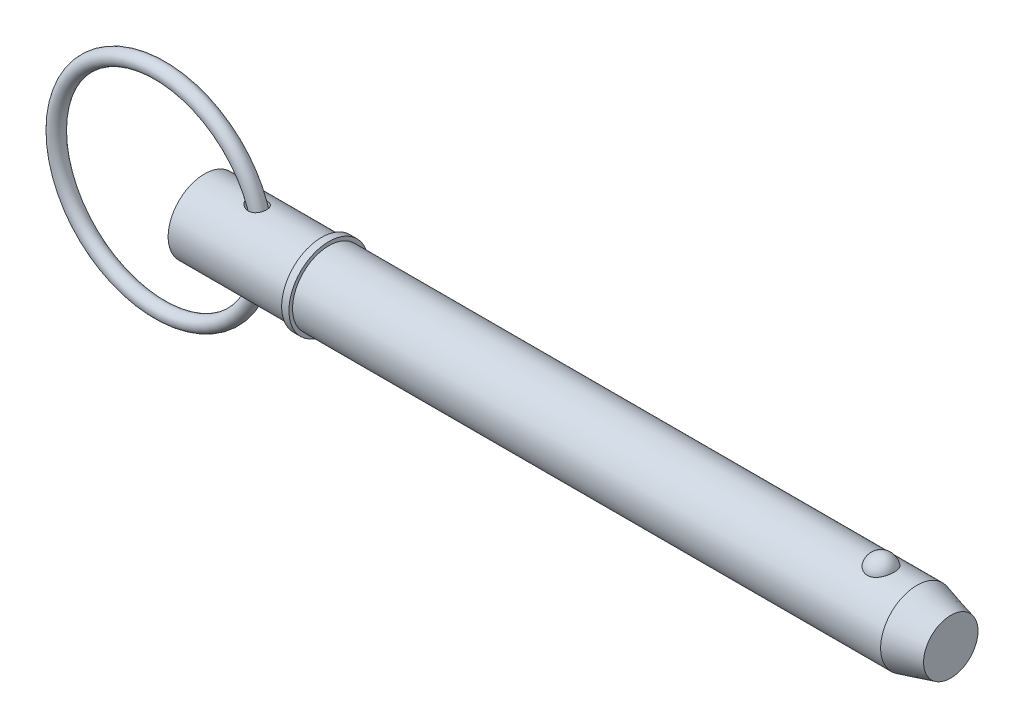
ISO-10303-21;
HEADER;
FILE_DESCRIPTION(('STEP AP214'),'2;1');
FILE_NAME('part.step','',(''),(''),'','','');
FILE_SCHEMA(('AUTOMOTIVE_DESIGN { 1 0 10303 214 1 1 1 1 }'));
ENDSEC;
DATA;
#1=APPLICATION_CONTEXT('core data for automotive mechanical design processes');
#2=APPLICATION_PROTOCOL_DEFINITION('international standard','automotive_design',2000,#1);
#3=PRODUCT_CONTEXT('',#1,'mechanical');
#4=PRODUCT('Part','Part','',(#3));
#5=PRODUCT_RELATED_PRODUCT_CATEGORY('part','',(#4));
#6=PRODUCT_DEFINITION_FORMATION('','',#4);
#7=PRODUCT_DEFINITION_CONTEXT('part definition',#1,'design');
#8=PRODUCT_DEFINITION('design','',#6,#7);
#9=PRODUCT_DEFINITION_SHAPE('','',#8);
#10=(LENGTH_UNIT() NAMED_UNIT(*) SI_UNIT(.MILLI.,.METRE.));
#11=(NAMED_UNIT(*) PLANE_ANGLE_UNIT() SI_UNIT($,.RADIAN.));
#12=(NAMED_UNIT(*) SI_UNIT($,.STERADIAN.) SOLID_ANGLE_UNIT());
#13=UNCERTAINTY_MEASURE_WITH_UNIT(LENGTH_MEASURE(1.E-05),#10,'distance_accuracy_value','');
#14=(GEOMETRIC_REPRESENTATION_CONTEXT(3) GLOBAL_UNCERTAINTY_ASSIGNED_CONTEXT((#13)) GLOBAL_UNIT_ASSIGNED_CONTEXT((#10,
#11,#12)) REPRESENTATION_CONTEXT('',''));
#15=CARTESIAN_POINT('',(0.,0.,0.));
#16=DIRECTION('',(0.,0.,1.));
#17=DIRECTION('',(1.,0.,0.));
#18=AXIS2_PLACEMENT_3D('',#15,#16,#17);
#19=CARTESIAN_POINT('',(-13.640845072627,0.,0.));
#20=DIRECTION('',(0.,0.,1.));
#21=DIRECTION('',(1.,0.,0.));
#22=AXIS2_PLACEMENT_3D('',#19,#20,#21);
#23=TOROIDAL_SURFACE('',#22,31.75,2.223);
#24=CARTESIAN_POINT('',(20.332154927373,0.,0.));
#25=VERTEX_POINT('',#24);
#26=VERTEX_LOOP('',#25);
#27=FACE_BOUND('',#26,.T.);
#28=ADVANCED_FACE('P0_F12',(#27),#23,.T.);
#29=CLOSED_SHELL('',(#28));
#30=MANIFOLD_SOLID_BREP('P0_B1',#29);
#31=CARTESIAN_POINT('',(0.,0.,0.));
#32=DIRECTION('',(1.,0.,0.));
#33=DIRECTION('',(0.,0.,-1.));
#34=AXIS2_PLACEMENT_3D('',#31,#32,#33);
#35=CYLINDRICAL_SURFACE('',#34,11.115);
#36=CARTESIAN_POINT('',(13.5245830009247,11.0328953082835,-1.34849772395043));
#37=CARTESIAN_POINT('',(13.6190616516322,11.0150940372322,-1.49413162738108));
#38=CARTESIAN_POINT('',(13.7272589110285,10.9954577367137,-1.63076546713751));
#39=CARTESIAN_POINT('',(13.9654537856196,10.9550099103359,-1.8834727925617));
#40=CARTESIAN_POINT('',(14.0954990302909,10.9341958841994,-1.99950019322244));
#41=CARTESIAN_POINT('',(14.3718600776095,10.893854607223,-2.20871939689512));
#42=CARTESIAN_POINT('',(14.5180879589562,10.8743212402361,-2.30202655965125));
#43=CARTESIAN_POINT('',(14.8233821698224,10.8385071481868,-2.46515115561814));
#44=CARTESIAN_POINT('',(14.9824448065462,10.8222254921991,-2.53497531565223));
#45=CARTESIAN_POINT('',(15.3233581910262,10.7936101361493,-2.65430007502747));
#46=CARTESIAN_POINT('',(15.5060064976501,10.7817126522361,-2.7016502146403));
#47=CARTESIAN_POINT('',(15.8771124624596,10.7657570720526,-2.76455948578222));
#48=CARTESIAN_POINT('',(16.0655695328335,10.7616981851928,-2.78012182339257));
#49=CARTESIAN_POINT('',(16.4345152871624,10.7624400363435,-2.77724928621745));
#50=CARTESIAN_POINT('',(16.6150121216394,10.7668823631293,-2.76018977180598));
#51=CARTESIAN_POINT('',(16.9695132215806,10.7837407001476,-2.69357457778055));
#52=CARTESIAN_POINT('',(17.1435222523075,10.7961507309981,-2.64404326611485));
#53=CARTESIAN_POINT('',(17.4621418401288,10.8258984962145,-2.51928348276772));
#54=CARTESIAN_POINT('',(17.6079677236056,10.8426430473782,-2.44700611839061));
#55=CARTESIAN_POINT('',(17.884162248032,10.8794194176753,-2.27791740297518));
#56=CARTESIAN_POINT('',(18.0145349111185,10.8994503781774,-2.18111245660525));
#57=CARTESIAN_POINT('',(18.2494965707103,10.9392822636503,-1.9713196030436));
#58=CARTESIAN_POINT('',(18.3550661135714,10.9590421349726,-1.85941863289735));
#59=CARTESIAN_POINT('',(18.5458147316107,10.9970986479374,-1.61919918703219));
#60=CARTESIAN_POINT('',(18.6309947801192,11.0153953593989,-1.49088149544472));
#61=CARTESIAN_POINT('',(18.7786686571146,11.0484675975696,-1.2218388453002));
#62=CARTESIAN_POINT('',(18.8412214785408,11.063252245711,-1.08114735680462));
#63=CARTESIAN_POINT('',(18.9425265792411,11.0877718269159,-0.791025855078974));
#64=CARTESIAN_POINT('',(18.9812780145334,11.0975065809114,-0.641595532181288));
#65=CARTESIAN_POINT('',(19.0343305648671,11.1109435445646,-0.336997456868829));
#66=CARTESIAN_POINT('',(19.0484404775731,11.1145985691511,-0.181794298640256));
#67=CARTESIAN_POINT('',(19.0513147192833,11.1153384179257,0.1288646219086));
#68=CARTESIAN_POINT('',(19.0400783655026,11.112423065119,0.284320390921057));
#69=CARTESIAN_POINT('',(18.9924362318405,11.1003163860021,0.591525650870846));
#70=CARTESIAN_POINT('',(18.9559600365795,11.0911075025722,0.743263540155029));
#71=CARTESIAN_POINT('',(18.858576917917,11.0673920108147,1.03825247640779));
#72=CARTESIAN_POINT('',(18.7976699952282,11.0528854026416,1.18150352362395));
#73=CARTESIAN_POINT('',(18.6529960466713,11.020201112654,1.45511394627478));
#74=CARTESIAN_POINT('',(18.5692772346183,11.0020311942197,1.58549973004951));
#75=CARTESIAN_POINT('',(18.3810003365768,10.9640237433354,1.82995492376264));
#76=CARTESIAN_POINT('',(18.2764441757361,10.9441863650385,1.9440258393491));
#77=CARTESIAN_POINT('',(18.0501398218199,10.9052267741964,2.15183128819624));
#78=CARTESIAN_POINT('',(17.9285270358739,10.8861003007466,2.24571250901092));
#79=CARTESIAN_POINT('',(17.6709592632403,10.8505244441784,2.41175942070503));
#80=CARTESIAN_POINT('',(17.5350055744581,10.8340748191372,2.48392707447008));
#81=CARTESIAN_POINT('',(17.2528390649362,10.8056099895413,2.60497667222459));
#82=CARTESIAN_POINT('',(17.1066353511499,10.7935909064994,2.65387899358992));
#83=CARTESIAN_POINT('',(16.8080326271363,10.7750969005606,2.72799859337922));
#84=CARTESIAN_POINT('',(16.6556326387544,10.7686228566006,2.75321211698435));
#85=CARTESIAN_POINT('',(16.3428877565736,10.761517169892,2.78086153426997));
#86=CARTESIAN_POINT('',(16.1824599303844,10.7611149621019,2.78240297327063));
#87=CARTESIAN_POINT('',(15.863296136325,10.766478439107,2.76156874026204));
#88=CARTESIAN_POINT('',(15.7045607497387,10.7722461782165,2.73918510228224));
#89=CARTESIAN_POINT('',(15.3787211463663,10.7898500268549,2.66904167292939));
#90=CARTESIAN_POINT('',(15.2120794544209,10.8021675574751,2.6192557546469));
#91=CARTESIAN_POINT('',(14.8886284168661,10.8315482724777,2.4949635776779));
#92=CARTESIAN_POINT('',(14.731827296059,10.8486153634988,2.42043695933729));
#93=CARTESIAN_POINT('',(14.4198762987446,10.8870804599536,2.24137362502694));
#94=CARTESIAN_POINT('',(14.2658484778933,10.9087148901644,2.13492229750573));
#95=CARTESIAN_POINT('',(13.9788214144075,10.9526299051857,1.89676517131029));
#96=CARTESIAN_POINT('',(13.845804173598,10.9749099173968,1.76508120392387));
#97=CARTESIAN_POINT('',(13.6310853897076,11.012885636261,1.50762337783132));
#98=CARTESIAN_POINT('',(13.5444453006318,11.0290026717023,1.38602082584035));
#99=CARTESIAN_POINT('',(13.392158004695,11.0581740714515,1.12983363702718));
#100=CARTESIAN_POINT('',(13.3264946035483,11.0712307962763,0.995259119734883));
#101=CARTESIAN_POINT('',(13.2464179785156,11.0874250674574,0.785640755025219));
#102=CARTESIAN_POINT('',(13.2227369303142,11.0922707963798,0.71416661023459));
#103=CARTESIAN_POINT('',(13.1820656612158,11.1006486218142,0.56927708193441));
#104=CARTESIAN_POINT('',(13.1650721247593,11.1041813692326,0.495862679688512));
#105=CARTESIAN_POINT('',(13.1381118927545,11.1098070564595,0.34771199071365));
#106=CARTESIAN_POINT('',(13.1281436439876,11.1119003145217,0.272975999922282));
#107=CARTESIAN_POINT('',(13.1154243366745,11.1145746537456,0.122890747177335));
#108=CARTESIAN_POINT('',(13.1126723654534,11.1151559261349,0.0475415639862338));
#109=CARTESIAN_POINT('',(13.1151602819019,11.1146296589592,-0.160384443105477));
#110=CARTESIAN_POINT('',(13.128061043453,11.111903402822,-0.292944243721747));
#111=CARTESIAN_POINT('',(13.175691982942,11.1019662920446,-0.553751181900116));
#112=CARTESIAN_POINT('',(13.2104121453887,11.094757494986,-0.682000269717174));
#113=CARTESIAN_POINT('',(13.2891255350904,11.0787645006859,-0.901873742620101));
#114=CARTESIAN_POINT('',(13.3290466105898,11.0707438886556,-0.995044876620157));
#115=CARTESIAN_POINT('',(13.4192915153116,11.0529876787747,-1.175992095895));
#116=CARTESIAN_POINT('',(13.4696154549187,11.0432520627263,-1.26376812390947));
#117=CARTESIAN_POINT('',(13.5245830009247,11.0328953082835,-1.34849772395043));
#118=B_SPLINE_CURVE_WITH_KNOTS('',3,(#36,#37,#38,#39,#40,#41,#42,#43,#44,#45,#46,#47,#48,#49,
#50,#51,#52,#53,#54,#55,#56,#57,#58,#59,#60,#61,#62,#63,#64,#65,#66,#67,#68,#69,#70,#71,#72,#73,
#74,#75,#76,#77,#78,#79,#80,#81,#82,#83,#84,#85,#86,#87,#88,#89,#90,#91,#92,#93,#94,#95,#96,#97,
#98,#99,#100,#101,#102,#103,#104,#105,#106,#107,#108,#109,#110,#111,#112,#113,#114,#115,#116,
#117),.UNSPECIFIED.,.T.,.F.,(4,2,2,2,2,2,2,2,2,2,2,2,2,2,2,2,2,2,2,2,2,2,2,2,2,2,2,2,2,2,2,2,2,
2,2,2,2,2,2,2,4),(0.,0.523099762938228,1.04735506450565,1.5688902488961,2.09027590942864,
2.65465173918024,3.21897064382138,3.76002078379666,4.30066536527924,4.78898318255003,
5.27717362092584,5.74028268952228,6.20336964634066,6.66524040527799,7.12712754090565,
7.59258295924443,8.05805091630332,8.52482272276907,8.99159451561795,9.45738731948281,
9.92313710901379,10.3853792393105,10.8475795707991,11.3093743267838,11.771242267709,
12.2505208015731,12.7299589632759,13.2508366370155,13.7721440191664,14.334890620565,
14.8971525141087,15.3459336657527,15.7943675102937,16.0204422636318,16.2464047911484,
16.4723173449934,16.6982013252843,17.095711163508,17.4930386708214,17.7973741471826,
18.1017128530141),.UNSPECIFIED.);
#119=CARTESIAN_POINT('',(13.5245830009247,11.0328953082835,-1.34849772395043));
#120=VERTEX_POINT('',#119);
#121=EDGE_CURVE('P1_E42',#120,#120,#118,.T.);
#122=ORIENTED_EDGE('',*,*,#121,.T.);
#123=EDGE_LOOP('',(#122));
#124=FACE_BOUND('',#123,.T.);
#125=CARTESIAN_POINT('',(0.,0.,0.));
#126=DIRECTION('',(1.,0.,0.));
#127=DIRECTION('',(0.,0.,-1.));
#128=AXIS2_PLACEMENT_3D('',#125,#126,#127);
#129=CIRCLE('',#128,11.115);
#130=CARTESIAN_POINT('',(0.,0.,-11.115));
#131=VERTEX_POINT('',#130);
#132=EDGE_CURVE('P1_E9',#131,#131,#129,.T.);
#133=ORIENTED_EDGE('',*,*,#132,.T.);
#134=EDGE_LOOP('',(#133));
#135=FACE_BOUND('',#134,.T.);
#136=CARTESIAN_POINT('',(35.877,0.,0.));
#137=DIRECTION('',(1.,0.,0.));
#138=DIRECTION('',(0.,0.,-1.));
#139=AXIS2_PLACEMENT_3D('',#136,#137,#138);
#140=CIRCLE('',#139,11.115);
#141=CARTESIAN_POINT('',(35.877,0.,-11.115));
#142=VERTEX_POINT('',#141);
#143=EDGE_CURVE('P1_E25',#142,#142,#140,.T.);
#144=ORIENTED_EDGE('',*,*,#143,.F.);
#145=EDGE_LOOP('',(#144));
#146=FACE_BOUND('',#145,.T.);
#147=CARTESIAN_POINT('',(13.5245830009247,-11.0328953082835,-1.34849772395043));
#148=CARTESIAN_POINT('',(13.449887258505,-11.0469690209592,-1.233356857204));
#149=CARTESIAN_POINT('',(13.3837464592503,-11.0598986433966,-1.11255897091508));
#150=CARTESIAN_POINT('',(13.271526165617,-11.0822620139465,-0.861680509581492));
#151=CARTESIAN_POINT('',(13.2254273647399,-11.0916991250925,-0.731609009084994));
#152=CARTESIAN_POINT('',(13.1557497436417,-11.1060943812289,-0.464578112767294));
#153=CARTESIAN_POINT('',(13.1322820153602,-11.111030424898,-0.327588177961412));
#154=CARTESIAN_POINT('',(13.1098958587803,-11.1157368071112,-0.0515139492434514));
#155=CARTESIAN_POINT('',(13.1109730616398,-11.1155080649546,0.087569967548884));
#156=CARTESIAN_POINT('',(13.1367722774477,-11.110088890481,0.354927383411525));
#157=CARTESIAN_POINT('',(13.160070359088,-11.1051972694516,0.483348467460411));
#158=CARTESIAN_POINT('',(13.2268311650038,-11.091413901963,0.734581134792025));
#159=CARTESIAN_POINT('',(13.2702981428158,-11.0825213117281,0.857391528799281));
#160=CARTESIAN_POINT('',(13.3769008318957,-11.0612491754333,1.09871322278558));
#161=CARTESIAN_POINT('',(13.4406446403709,-11.048763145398,1.21694419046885));
#162=CARTESIAN_POINT('',(13.5844860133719,-11.0215642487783,1.44267020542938));
#163=CARTESIAN_POINT('',(13.6645903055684,-11.0068504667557,1.55016080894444));
#164=CARTESIAN_POINT('',(13.8511803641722,-10.9741237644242,1.76795565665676));
#165=CARTESIAN_POINT('',(13.959808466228,-10.9559422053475,1.87639683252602));
#166=CARTESIAN_POINT('',(14.1916437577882,-10.9197998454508,2.07642617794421));
#167=CARTESIAN_POINT('',(14.3148607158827,-10.901839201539,2.16800294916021));
#168=CARTESIAN_POINT('',(14.5931107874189,-10.8649902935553,2.34622033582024));
#169=CARTESIAN_POINT('',(14.7501095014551,-10.8463937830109,2.42986679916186));
#170=CARTESIAN_POINT('',(15.0757118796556,-10.8136392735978,2.57171975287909));
#171=CARTESIAN_POINT('',(15.2443214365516,-10.7994835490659,2.62991321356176));
#172=CARTESIAN_POINT('',(15.599068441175,-10.7767894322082,2.72147498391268));
#173=CARTESIAN_POINT('',(15.7856559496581,-10.768622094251,2.75321798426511));
#174=CARTESIAN_POINT('',(16.1617095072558,-10.7608206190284,2.78356776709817));
#175=CARTESIAN_POINT('',(16.3511739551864,-10.7611818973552,2.78219235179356));
#176=CARTESIAN_POINT('',(16.7138126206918,-10.7705428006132,2.7457129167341));
#177=CARTESIAN_POINT('',(16.8872269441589,-10.7789612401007,2.71287798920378));
#178=CARTESIAN_POINT('',(17.2247245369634,-10.8028011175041,2.61632772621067));
#179=CARTESIAN_POINT('',(17.3888134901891,-10.8182182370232,2.55263143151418));
#180=CARTESIAN_POINT('',(17.6871641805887,-10.8524191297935,2.40281428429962));
#181=CARTESIAN_POINT('',(17.8227812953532,-10.8707652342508,2.31928155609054));
#182=CARTESIAN_POINT('',(18.0770765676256,-10.9094513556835,2.12988301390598));
#183=CARTESIAN_POINT('',(18.1957578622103,-10.9297910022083,2.02402134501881));
#184=CARTESIAN_POINT('',(18.4088055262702,-10.9693230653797,1.79719870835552));
#185=CARTESIAN_POINT('',(18.5038890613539,-10.9885305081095,1.67691225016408));
#186=CARTESIAN_POINT('',(18.6726701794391,-11.0244347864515,1.42183894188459));
#187=CARTESIAN_POINT('',(18.7463681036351,-11.0411316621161,1.28705232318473));
#188=CARTESIAN_POINT('',(18.8708297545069,-11.0702507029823,1.00634471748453));
#189=CARTESIAN_POINT('',(18.9215212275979,-11.0826593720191,0.860390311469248));
#190=CARTESIAN_POINT('',(18.9984973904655,-11.1017993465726,0.561823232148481));
#191=CARTESIAN_POINT('',(19.0247811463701,-11.1085304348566,0.409210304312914));
#192=CARTESIAN_POINT('',(19.0524622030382,-11.1156244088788,0.100537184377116));
#193=CARTESIAN_POINT('',(19.0536873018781,-11.1159432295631,-0.0555394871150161));
#194=CARTESIAN_POINT('',(19.0307837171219,-11.110065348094,-0.365700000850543));
#195=CARTESIAN_POINT('',(19.0066544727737,-11.1038685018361,-0.519783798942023));
#196=CARTESIAN_POINT('',(18.9335163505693,-11.0856111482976,-0.821817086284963));
#197=CARTESIAN_POINT('',(18.8844701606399,-11.0735418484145,-0.969757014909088));
#198=CARTESIAN_POINT('',(18.7625929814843,-11.0448501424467,-1.25502066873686));
#199=CARTESIAN_POINT('',(18.6897623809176,-11.0282278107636,-1.39234456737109));
#200=CARTESIAN_POINT('',(18.522359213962,-10.9923333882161,-1.65195905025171));
#201=CARTESIAN_POINT('',(18.427863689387,-10.9730707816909,-1.77430060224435));
#202=CARTESIAN_POINT('',(18.2194216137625,-10.9340072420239,-2.00099176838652));
#203=CARTESIAN_POINT('',(18.1054772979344,-10.9142063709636,-2.10534344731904));
#204=CARTESIAN_POINT('',(17.8622613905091,-10.8764452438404,-2.2924289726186));
#205=CARTESIAN_POINT('',(17.7331196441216,-10.8584715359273,-2.3753290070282));
#206=CARTESIAN_POINT('',(17.4625069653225,-10.8261386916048,-2.51860389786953));
#207=CARTESIAN_POINT('',(17.3210365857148,-10.8117793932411,-2.57897976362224));
#208=CARTESIAN_POINT('',(17.0290309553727,-10.7880576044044,-2.67648805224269));
#209=CARTESIAN_POINT('',(16.8784484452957,-10.7787241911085,-2.71348542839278));
#210=CARTESIAN_POINT('',(16.573148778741,-10.7659618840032,-2.7636855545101));
#211=CARTESIAN_POINT('',(16.4184306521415,-10.7625343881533,-2.77688267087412));
#212=CARTESIAN_POINT('',(16.1008073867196,-10.761643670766,-2.78033419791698));
#213=CARTESIAN_POINT('',(15.9378898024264,-10.7644957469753,-2.76937572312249));
#214=CARTESIAN_POINT('',(15.6157286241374,-10.7762062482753,-2.72344300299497));
#215=CARTESIAN_POINT('',(15.4564861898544,-10.7850665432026,-2.68846128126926));
#216=CARTESIAN_POINT('',(15.1305734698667,-10.808737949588,-2.59174021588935));
#217=CARTESIAN_POINT('',(14.9645834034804,-10.8240246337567,-2.52782071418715));
#218=CARTESIAN_POINT('',(14.6448218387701,-10.8585969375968,-2.37491543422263));
#219=CARTESIAN_POINT('',(14.4910653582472,-10.8778873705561,-2.28589943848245));
#220=CARTESIAN_POINT('',(14.1837929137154,-10.920550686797,-2.07312951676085));
#221=CARTESIAN_POINT('',(14.0321999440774,-10.9441390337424,-1.94661563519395));
#222=CARTESIAN_POINT('',(13.756115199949,-10.9902311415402,-1.66673537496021));
#223=CARTESIAN_POINT('',(13.6315733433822,-11.0127368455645,-1.51341958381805));
#224=CARTESIAN_POINT('',(13.5245830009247,-11.0328953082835,-1.34849772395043));
#225=B_SPLINE_CURVE_WITH_KNOTS('',3,(#147,#148,#149,#150,#151,#152,#153,#154,#155,#156,#157,
#158,#159,#160,#161,#162,#163,#164,#165,#166,#167,#168,#169,#170,#171,#172,#173,#174,#175,#176,
#177,#178,#179,#180,#181,#182,#183,#184,#185,#186,#187,#188,#189,#190,#191,#192,#193,#194,#195,
#196,#197,#198,#199,#200,#201,#202,#203,#204,#205,#206,#207,#208,#209,#210,#211,#212,#213,#214,
#215,#216,#217,#218,#219,#220,#221,#222,#223,#224),.UNSPECIFIED.,.T.,.F.,(4,2,2,2,2,2,2,2,2,2,2,
2,2,2,2,2,2,2,2,2,2,2,2,2,2,2,2,2,2,2,2,2,2,2,2,2,2,2,4),(0.,0.413394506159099,
0.826389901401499,1.24140245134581,1.65634113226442,2.04635967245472,2.43646050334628,
2.83958259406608,3.24287078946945,3.70479277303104,4.16702582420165,4.70130512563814,
5.23585761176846,5.80123945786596,6.36631739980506,6.89348344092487,7.42032464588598,
7.8989135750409,8.37741373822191,8.83881993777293,9.30021877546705,9.76305681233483,
10.2259125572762,10.6919479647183,11.1579936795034,11.6247393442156,12.0914773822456,
12.55658073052,13.0216306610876,13.4829619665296,13.9442725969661,14.408224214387,
14.8722856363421,15.3601762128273,15.8482186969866,16.3815107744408,16.9154477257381,
17.5086806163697,18.1008056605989),.UNSPECIFIED.);
#226=CARTESIAN_POINT('',(13.5245830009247,-11.0328953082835,-1.34849772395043));
#227=VERTEX_POINT('',#226);
#228=EDGE_CURVE('P1_E17',#227,#227,#225,.T.);
#229=ORIENTED_EDGE('',*,*,#228,.T.);
#230=EDGE_LOOP('',(#229));
#231=FACE_BOUND('',#230,.T.);
#232=ADVANCED_FACE('P1_F13',(#124,#135,#146,#231),#35,.T.);
#233=CARTESIAN_POINT('',(0.,0.,0.));
#234=DIRECTION('',(1.,0.,0.));
#235=DIRECTION('',(0.,0.,-1.));
#236=AXIS2_PLACEMENT_3D('',#233,#234,#235);
#237=CYLINDRICAL_SURFACE('',#236,11.115);
#238=CARTESIAN_POINT('',(218.229563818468,0.,0.));
#239=DIRECTION('',(1.,0.,0.));
#240=DIRECTION('',(0.,0.,-1.));
#241=AXIS2_PLACEMENT_3D('',#238,#239,#240);
#242=CIRCLE('',#241,11.115);
#243=CARTESIAN_POINT('',(218.229563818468,0.,-11.115));
#244=VERTEX_POINT('',#243);
#245=EDGE_CURVE('P1_E99',#244,#244,#242,.T.);
#246=ORIENTED_EDGE('',*,*,#245,.F.);
#247=EDGE_LOOP('',(#246));
#248=FACE_BOUND('',#247,.T.);
#249=CARTESIAN_POINT('',(38.1,0.,0.));
#250=DIRECTION('',(1.,0.,0.));
#251=DIRECTION('',(0.,0.,-1.));
#252=AXIS2_PLACEMENT_3D('',#249,#250,#251);
#253=CIRCLE('',#252,11.115);
#254=CARTESIAN_POINT('',(38.1,0.,-11.115));
#255=VERTEX_POINT('',#254);
#256=EDGE_CURVE('P1_E96',#255,#255,#253,.T.);
#257=ORIENTED_EDGE('',*,*,#256,.T.);
#258=EDGE_LOOP('',(#257));
#259=FACE_BOUND('',#258,.T.);
#260=CARTESIAN_POINT('',(207.231068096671,10.3028087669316,4.17077409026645));
#261=CARTESIAN_POINT('',(207.014775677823,10.3028003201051,4.17078240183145));
#262=CARTESIAN_POINT('',(206.798548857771,10.3098895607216,4.15340593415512));
#263=CARTESIAN_POINT('',(206.372540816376,10.3373834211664,4.08449540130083));
#264=CARTESIAN_POINT('',(206.162757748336,10.3577841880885,4.0329712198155));
#265=CARTESIAN_POINT('',(205.755782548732,10.4095237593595,3.89746513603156));
#266=CARTESIAN_POINT('',(205.558572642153,10.4408466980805,3.81353029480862));
#267=CARTESIAN_POINT('',(205.181338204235,10.5110236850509,3.61560339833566));
#268=CARTESIAN_POINT('',(205.001317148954,10.5498792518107,3.50160528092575));
#269=CARTESIAN_POINT('',(204.657684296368,10.6322884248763,3.24292464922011));
#270=CARTESIAN_POINT('',(204.494686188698,10.6759443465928,3.09746040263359));
#271=CARTESIAN_POINT('',(204.194591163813,10.7625291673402,2.7817192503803));
#272=CARTESIAN_POINT('',(204.057499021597,10.8054579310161,2.61143778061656));
#273=CARTESIAN_POINT('',(203.806408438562,10.8881935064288,2.24226695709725));
#274=CARTESIAN_POINT('',(203.693710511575,10.9277761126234,2.04244123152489));
#275=CARTESIAN_POINT('',(203.501777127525,10.997484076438,1.62578254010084));
#276=CARTESIAN_POINT('',(203.422544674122,11.0276085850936,1.40894804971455));
#277=CARTESIAN_POINT('',(203.298303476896,11.0756732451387,0.961250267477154));
#278=CARTESIAN_POINT('',(203.253760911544,11.0934470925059,0.730239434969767));
#279=CARTESIAN_POINT('',(203.201569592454,11.1143331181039,0.263439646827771));
#280=CARTESIAN_POINT('',(203.193920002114,11.1174456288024,0.0276507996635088));
#281=CARTESIAN_POINT('',(203.21561056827,11.1087161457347,-0.440729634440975));
#282=CARTESIAN_POINT('',(203.244762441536,11.0969502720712,-0.673331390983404));
#283=CARTESIAN_POINT('',(203.339143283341,11.0597872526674,-1.12996621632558));
#284=CARTESIAN_POINT('',(203.404372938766,11.0343898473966,-1.35399912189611));
#285=CARTESIAN_POINT('',(203.56969844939,10.972515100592,-1.78750286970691));
#286=CARTESIAN_POINT('',(203.66983863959,10.9360236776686,-1.99695478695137));
#287=CARTESIAN_POINT('',(203.902940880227,10.8557595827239,-2.39520667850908));
#288=CARTESIAN_POINT('',(204.035905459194,10.8119863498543,-2.58400506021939));
#289=CARTESIAN_POINT('',(204.332407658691,10.7216733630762,-2.93635726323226));
#290=CARTESIAN_POINT('',(204.496056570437,10.675123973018,-3.09981510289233));
#291=CARTESIAN_POINT('',(204.849860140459,10.5846571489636,-3.39592247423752));
#292=CARTESIAN_POINT('',(205.040012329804,10.5407394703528,-3.52857487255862));
#293=CARTESIAN_POINT('',(205.43750141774,10.4616690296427,-3.75646057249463));
#294=CARTESIAN_POINT('',(205.64436705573,10.4263443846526,-3.85245432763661));
#295=CARTESIAN_POINT('',(206.072954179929,10.3675574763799,-4.00798747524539));
#296=CARTESIAN_POINT('',(206.294670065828,10.344090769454,-4.0675405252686));
#297=CARTESIAN_POINT('',(206.734669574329,10.3128282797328,-4.14614314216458));
#298=CARTESIAN_POINT('',(206.952565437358,10.3043040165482,-4.1670783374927));
#299=CARTESIAN_POINT('',(207.38894951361,10.3016771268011,-4.17357158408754));
#300=CARTESIAN_POINT('',(207.607437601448,10.3075716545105,-4.15913661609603));
#301=CARTESIAN_POINT('',(208.031744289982,10.3326686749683,-4.09636961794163));
#302=CARTESIAN_POINT('',(208.237745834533,10.3514555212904,-4.0490957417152));
#303=CARTESIAN_POINT('',(208.638576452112,10.399818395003,-3.92320197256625));
#304=CARTESIAN_POINT('',(208.8334046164,10.4293952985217,-3.84457953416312));
#305=CARTESIAN_POINT('',(209.211191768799,10.4969600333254,-3.65612410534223));
#306=CARTESIAN_POINT('',(209.393797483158,10.5351178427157,-3.54564545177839));
#307=CARTESIAN_POINT('',(209.738204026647,10.6154999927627,-3.29718036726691));
#308=CARTESIAN_POINT('',(209.900000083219,10.657725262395,-3.15918764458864));
#309=CARTESIAN_POINT('',(210.206959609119,10.744212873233,-2.85163580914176));
#310=CARTESIAN_POINT('',(210.350891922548,10.7884718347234,-2.68084605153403));
#311=CARTESIAN_POINT('',(210.609237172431,10.872374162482,-2.31721864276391));
#312=CARTESIAN_POINT('',(210.723644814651,10.9120167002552,-2.12437704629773));
#313=CARTESIAN_POINT('',(210.923873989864,10.9838919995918,-1.71516999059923));
#314=CARTESIAN_POINT('',(211.00866178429,11.0158465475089,-1.49824866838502));
#315=CARTESIAN_POINT('',(211.14268382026,11.0673523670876,-1.05228572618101));
#316=CARTESIAN_POINT('',(211.191917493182,11.086903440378,-0.823243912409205));
#317=CARTESIAN_POINT('',(211.253891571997,11.1116323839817,-0.359087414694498));
#318=CARTESIAN_POINT('',(211.266566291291,11.1167843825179,-0.123962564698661));
#319=CARTESIAN_POINT('',(211.254973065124,11.1121144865,0.345220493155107));
#320=CARTESIAN_POINT('',(211.230705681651,11.1022928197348,0.579278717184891));
#321=CARTESIAN_POINT('',(211.145907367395,11.0687504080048,1.03866534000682));
#322=CARTESIAN_POINT('',(211.085529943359,11.0450885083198,1.26402641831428));
#323=CARTESIAN_POINT('',(210.929853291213,10.9863185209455,1.70076772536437));
#324=CARTESIAN_POINT('',(210.834551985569,10.9512097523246,1.91214712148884));
#325=CARTESIAN_POINT('',(210.610397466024,10.8729733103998,2.316083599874));
#326=CARTESIAN_POINT('',(210.481380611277,10.8298068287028,2.50854240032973));
#327=CARTESIAN_POINT('',(210.192732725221,10.7401896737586,2.86808766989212));
#328=CARTESIAN_POINT('',(210.033102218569,10.6937390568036,3.03517457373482));
#329=CARTESIAN_POINT('',(209.687534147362,10.6029321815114,3.33857581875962));
#330=CARTESIAN_POINT('',(209.501708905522,10.5585680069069,3.47501541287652));
#331=CARTESIAN_POINT('',(209.107875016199,10.4769321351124,3.71390897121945));
#332=CARTESIAN_POINT('',(208.899863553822,10.439661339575,3.81635861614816));
#333=CARTESIAN_POINT('',(208.454066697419,10.3749407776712,3.98910631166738));
#334=CARTESIAN_POINT('',(208.215234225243,10.3482457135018,4.05700929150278));
#335=CARTESIAN_POINT('',(207.727925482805,10.312188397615,4.14782844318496));
#336=CARTESIAN_POINT('',(207.479453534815,10.3028184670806,4.17076454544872));
#337=CARTESIAN_POINT('',(207.231068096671,10.3028087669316,4.17077409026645));
#338=B_SPLINE_CURVE_WITH_KNOTS('',3,(#260,#261,#262,#263,#264,#265,#266,#267,#268,#269,#270,
#271,#272,#273,#274,#275,#276,#277,#278,#279,#280,#281,#282,#283,#284,#285,#286,#287,#288,#289,
#290,#291,#292,#293,#294,#295,#296,#297,#298,#299,#300,#301,#302,#303,#304,#305,#306,#307,#308,
#309,#310,#311,#312,#313,#314,#315,#316,#317,#318,#319,#320,#321,#322,#323,#324,#325,#326,#327,
#328,#329,#330,#331,#332,#333,#334,#335,#336,#337),.UNSPECIFIED.,.T.,.F.,(4,2,2,2,2,2,2,2,2,2,2,
2,2,2,2,2,2,2,2,2,2,2,2,2,2,2,2,2,2,2,2,2,2,2,2,2,2,2,4),(0.,0.64796614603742,1.29574482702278,
1.9425864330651,2.58955857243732,3.25496465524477,3.92049326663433,4.61566368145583,
5.31089647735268,6.01531821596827,6.71972398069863,7.42054043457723,8.12137023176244,
8.82309331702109,9.5248704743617,10.2292439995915,10.9335519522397,11.6223330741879,
12.3108558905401,12.9647664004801,13.6185478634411,14.252184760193,14.8858731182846,
15.5334360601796,16.1811472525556,16.8611459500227,17.5412664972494,18.2431855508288,
18.9451158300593,19.6483065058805,20.3514864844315,21.0516982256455,21.7519516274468,
22.4556690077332,23.1593743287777,23.8601491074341,24.5610129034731,25.3054529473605,
26.049562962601),.UNSPECIFIED.);
#339=CARTESIAN_POINT('',(207.231068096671,10.3028087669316,4.17077409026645));
#340=VERTEX_POINT('',#339);
#341=EDGE_CURVE('P1_E34',#340,#340,#338,.T.);
#342=ORIENTED_EDGE('',*,*,#341,.T.);
#343=EDGE_LOOP('',(#342));
#344=FACE_BOUND('',#343,.T.);
#345=ADVANCED_FACE('P1_F46',(#248,#259,#344),#237,.T.);
#346=CARTESIAN_POINT('',(0.,0.,0.));
#347=DIRECTION('',(-1.,0.,0.));
#348=DIRECTION('',(0.,0.,1.));
#349=AXIS2_PLACEMENT_3D('',#346,#347,#348);
#350=PLANE('',#349);
#351=ORIENTED_EDGE('',*,*,#132,.F.);
#352=EDGE_LOOP('',(#351));
#353=FACE_BOUND('',#352,.T.);
#354=ADVANCED_FACE('P1_F15',(#353),#350,.T.);
#355=CARTESIAN_POINT('',(35.877,11.115,0.));
#356=DIRECTION('',(-1.,0.,0.));
#357=DIRECTION('',(0.,0.,1.));
#358=AXIS2_PLACEMENT_3D('',#355,#356,#357);
#359=PLANE('',#358);
#360=ORIENTED_EDGE('',*,*,#143,.T.);
#361=EDGE_LOOP('',(#360));
#362=FACE_BOUND('',#361,.T.);
#363=CARTESIAN_POINT('',(35.877,0.,0.));
#364=DIRECTION('',(1.,0.,0.));
#365=DIRECTION('',(0.,0.,-1.));
#366=AXIS2_PLACEMENT_3D('',#363,#364,#365);
#367=CIRCLE('',#366,12.2265);
#368=CARTESIAN_POINT('',(35.877,0.,-12.2265));
#369=VERTEX_POINT('',#368);
#370=EDGE_CURVE('P1_E30',#369,#369,#367,.T.);
#371=ORIENTED_EDGE('',*,*,#370,.F.);
#372=EDGE_LOOP('',(#371));
#373=FACE_BOUND('',#372,.T.);
#374=ADVANCED_FACE('P1_F81',(#362,#373),#359,.T.);
#375=CARTESIAN_POINT('',(0.,0.,0.));
#376=DIRECTION('',(1.,0.,0.));
#377=DIRECTION('',(0.,0.,-1.));
#378=AXIS2_PLACEMENT_3D('',#375,#376,#377);
#379=CYLINDRICAL_SURFACE('',#378,12.2265);
#380=ORIENTED_EDGE('',*,*,#370,.T.);
#381=EDGE_LOOP('',(#380));
#382=FACE_BOUND('',#381,.T.);
#383=CARTESIAN_POINT('',(38.1,0.,0.));
#384=DIRECTION('',(1.,0.,0.));
#385=DIRECTION('',(0.,0.,-1.));
#386=AXIS2_PLACEMENT_3D('',#383,#384,#385);
#387=CIRCLE('',#386,12.2265);
#388=CARTESIAN_POINT('',(38.1,0.,-12.2265));
#389=VERTEX_POINT('',#388);
#390=EDGE_CURVE('P1_E95',#389,#389,#387,.T.);
#391=ORIENTED_EDGE('',*,*,#390,.F.);
#392=EDGE_LOOP('',(#391));
#393=FACE_BOUND('',#392,.T.);
#394=ADVANCED_FACE('P1_F68',(#382,#393),#379,.T.);
#395=CARTESIAN_POINT('',(38.1,12.2265,0.));
#396=DIRECTION('',(1.,0.,0.));
#397=DIRECTION('',(0.,0.,-1.));
#398=AXIS2_PLACEMENT_3D('',#395,#396,#397);
#399=PLANE('',#398);
#400=ORIENTED_EDGE('',*,*,#390,.T.);
#401=EDGE_LOOP('',(#400));
#402=FACE_BOUND('',#401,.T.);
#403=ORIENTED_EDGE('',*,*,#256,.F.);
#404=EDGE_LOOP('',(#403));
#405=FACE_BOUND('',#404,.T.);
#406=ADVANCED_FACE('P1_F62',(#402,#405),#399,.T.);
#407=CARTESIAN_POINT('',(228.6,0.,0.));
#408=DIRECTION('',(-1.,0.,0.));
#409=DIRECTION('',(0.,0.,1.));
#410=AXIS2_PLACEMENT_3D('',#407,#408,#409);
#411=CONICAL_SURFACE('',#410,8.33625000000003,0.26179938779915);
#412=ORIENTED_EDGE('',*,*,#245,.T.);
#413=EDGE_LOOP('',(#412));
#414=FACE_BOUND('',#413,.T.);
#415=CARTESIAN_POINT('',(228.6,0.,0.));
#416=DIRECTION('',(1.,0.,0.));
#417=DIRECTION('',(0.,0.,-1.));
#418=AXIS2_PLACEMENT_3D('',#415,#416,#417);
#419=CIRCLE('',#418,8.33625000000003);
#420=CARTESIAN_POINT('',(228.6,0.,-8.33625000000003));
#421=VERTEX_POINT('',#420);
#422=EDGE_CURVE('P1_E41',#421,#421,#419,.T.);
#423=ORIENTED_EDGE('',*,*,#422,.F.);
#424=EDGE_LOOP('',(#423));
#425=FACE_BOUND('',#424,.T.);
#426=ADVANCED_FACE('P1_F59',(#414,#425),#411,.T.);
#427=CARTESIAN_POINT('',(228.6,8.33625000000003,0.));
#428=DIRECTION('',(1.,0.,0.));
#429=DIRECTION('',(0.,0.,-1.));
#430=AXIS2_PLACEMENT_3D('',#427,#428,#429);
#431=PLANE('',#430);
#432=ORIENTED_EDGE('',*,*,#422,.T.);
#433=EDGE_LOOP('',(#432));
#434=FACE_BOUND('',#433,.T.);
#435=ADVANCED_FACE('P1_F55',(#434),#431,.T.);
#436=CARTESIAN_POINT('',(207.231068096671,10.0035,0.));
#437=DIRECTION('',(-1.,0.,0.));
#438=DIRECTION('',(0.,1.,0.));
#439=AXIS2_PLACEMENT_3D('',#436,#437,#438);
#440=SPHERICAL_SURFACE('',#439,4.18150000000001);
#441=ORIENTED_EDGE('',*,*,#341,.F.);
#442=EDGE_LOOP('',(#441));
#443=FACE_BOUND('',#442,.T.);
#444=ADVANCED_FACE('P1_F50',(#443),#440,.T.);
#445=CARTESIAN_POINT('',(-13.640845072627,0.,0.));
#446=DIRECTION('',(0.,0.,1.));
#447=DIRECTION('',(1.,0.,0.));
#448=AXIS2_PLACEMENT_3D('',#445,#446,#447);
#449=TOROIDAL_SURFACE('',#448,31.75,2.77875);
#450=ORIENTED_EDGE('',*,*,#228,.F.);
#451=EDGE_LOOP('',(#450));
#452=FACE_BOUND('',#451,.T.);
#453=ORIENTED_EDGE('',*,*,#121,.F.);
#454=EDGE_LOOP('',(#453));
#455=FACE_BOUND('',#454,.T.);
#456=ADVANCED_FACE('P1_F54',(#452,#455),#449,.F.);
#457=CLOSED_SHELL('',(#232,#345,#354,#374,#394,#406,#426,#435,#444,#456));
#458=MANIFOLD_SOLID_BREP('P1_B1',#457);
#459=ADVANCED_BREP_SHAPE_REPRESENTATION('',(#18,#30,#458),#14);
#460=SHAPE_DEFINITION_REPRESENTATION(#9,#459);
ENDSEC;
END-ISO-10303-21;
